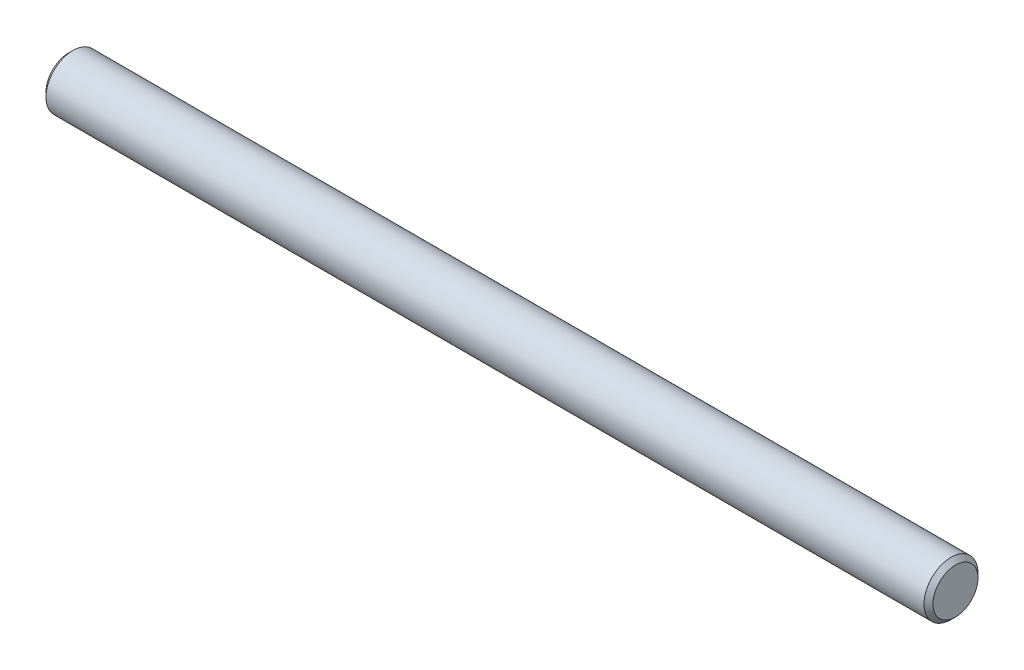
ISO-10303-21;
HEADER;
FILE_DESCRIPTION(('STEP AP214'),'2;1');
FILE_NAME('part.step','',(''),(''),'','','');
FILE_SCHEMA(('AUTOMOTIVE_DESIGN { 1 0 10303 214 1 1 1 1 }'));
ENDSEC;
DATA;
#1=APPLICATION_CONTEXT('core data for automotive mechanical design processes');
#2=APPLICATION_PROTOCOL_DEFINITION('international standard','automotive_design',2000,#1);
#3=PRODUCT_CONTEXT('',#1,'mechanical');
#4=PRODUCT('Part','Part','',(#3));
#5=PRODUCT_RELATED_PRODUCT_CATEGORY('part','',(#4));
#6=PRODUCT_DEFINITION_FORMATION('','',#4);
#7=PRODUCT_DEFINITION_CONTEXT('part definition',#1,'design');
#8=PRODUCT_DEFINITION('design','',#6,#7);
#9=PRODUCT_DEFINITION_SHAPE('','',#8);
#10=(LENGTH_UNIT() NAMED_UNIT(*) SI_UNIT(.MILLI.,.METRE.));
#11=(NAMED_UNIT(*) PLANE_ANGLE_UNIT() SI_UNIT($,.RADIAN.));
#12=(NAMED_UNIT(*) SI_UNIT($,.STERADIAN.) SOLID_ANGLE_UNIT());
#13=UNCERTAINTY_MEASURE_WITH_UNIT(LENGTH_MEASURE(1.E-05),#10,'distance_accuracy_value','');
#14=(GEOMETRIC_REPRESENTATION_CONTEXT(3) GLOBAL_UNCERTAINTY_ASSIGNED_CONTEXT((#13)) GLOBAL_UNIT_ASSIGNED_CONTEXT((#10,
#11,#12)) REPRESENTATION_CONTEXT('',''));
#15=CARTESIAN_POINT('',(0.,0.,0.));
#16=DIRECTION('',(0.,0.,1.));
#17=DIRECTION('',(1.,0.,0.));
#18=AXIS2_PLACEMENT_3D('',#15,#16,#17);
#19=CARTESIAN_POINT('',(197.,0.,0.));
#20=DIRECTION('',(-1.,0.,0.));
#21=DIRECTION('',(0.,0.,1.));
#22=AXIS2_PLACEMENT_3D('',#19,#20,#21);
#23=CYLINDRICAL_SURFACE('',#22,6.);
#24=CARTESIAN_POINT('',(196.,0.,0.));
#25=DIRECTION('',(1.,0.,0.));
#26=DIRECTION('',(0.,0.,-1.));
#27=AXIS2_PLACEMENT_3D('',#24,#25,#26);
#28=CIRCLE('',#27,6.);
#29=CARTESIAN_POINT('',(196.,0.,-6.));
#30=VERTEX_POINT('',#29);
#31=EDGE_CURVE('E9178',#30,#30,#28,.F.);
#32=ORIENTED_EDGE('',*,*,#31,.T.);
#33=EDGE_LOOP('',(#32));
#34=FACE_BOUND('',#33,.T.);
#35=CARTESIAN_POINT('',(1.,0.,0.));
#36=DIRECTION('',(1.,0.,0.));
#37=DIRECTION('',(0.,0.,-1.));
#38=AXIS2_PLACEMENT_3D('',#35,#36,#37);
#39=CIRCLE('',#38,6.);
#40=CARTESIAN_POINT('',(1.,0.,-6.));
#41=VERTEX_POINT('',#40);
#42=EDGE_CURVE('E9182',#41,#41,#39,.T.);
#43=ORIENTED_EDGE('',*,*,#42,.T.);
#44=EDGE_LOOP('',(#43));
#45=FACE_BOUND('',#44,.T.);
#46=ADVANCED_FACE('F9172',(#34,#45),#23,.T.);
#47=CARTESIAN_POINT('',(197.,0.,0.));
#48=DIRECTION('',(1.,0.,0.));
#49=DIRECTION('',(0.,0.,-1.));
#50=AXIS2_PLACEMENT_3D('',#47,#48,#49);
#51=PLANE('',#50);
#52=CARTESIAN_POINT('',(197.,0.,0.));
#53=DIRECTION('',(1.,0.,0.));
#54=DIRECTION('',(0.,0.,-1.));
#55=AXIS2_PLACEMENT_3D('',#52,#53,#54);
#56=CIRCLE('',#55,5.);
#57=CARTESIAN_POINT('',(197.,0.,-5.));
#58=VERTEX_POINT('',#57);
#59=EDGE_CURVE('E9186',#58,#58,#56,.T.);
#60=ORIENTED_EDGE('',*,*,#59,.T.);
#61=EDGE_LOOP('',(#60));
#62=FACE_BOUND('',#61,.T.);
#63=ADVANCED_FACE('F9192',(#62),#51,.T.);
#64=CARTESIAN_POINT('',(0.,0.,0.));
#65=DIRECTION('',(1.,0.,0.));
#66=DIRECTION('',(0.,0.,-1.));
#67=AXIS2_PLACEMENT_3D('',#64,#65,#66);
#68=PLANE('',#67);
#69=CARTESIAN_POINT('',(0.,0.,0.));
#70=DIRECTION('',(1.,0.,0.));
#71=DIRECTION('',(0.,0.,-1.));
#72=AXIS2_PLACEMENT_3D('',#69,#70,#71);
#73=CIRCLE('',#72,5.00000000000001);
#74=CARTESIAN_POINT('',(0.,0.,-5.00000000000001));
#75=VERTEX_POINT('',#74);
#76=EDGE_CURVE('E10',#75,#75,#73,.F.);
#77=ORIENTED_EDGE('',*,*,#76,.T.);
#78=EDGE_LOOP('',(#77));
#79=FACE_BOUND('',#78,.T.);
#80=ADVANCED_FACE('F9197',(#79),#68,.F.);
#81=CARTESIAN_POINT('',(197.,0.,0.));
#82=DIRECTION('',(-1.,0.,0.));
#83=DIRECTION('',(0.,0.,1.));
#84=AXIS2_PLACEMENT_3D('',#81,#82,#83);
#85=CONICAL_SURFACE('',#84,5.,0.785398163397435);
#86=ORIENTED_EDGE('',*,*,#31,.F.);
#87=EDGE_LOOP('',(#86));
#88=FACE_BOUND('',#87,.T.);
#89=ORIENTED_EDGE('',*,*,#59,.F.);
#90=EDGE_LOOP('',(#89));
#91=FACE_BOUND('',#90,.T.);
#92=ADVANCED_FACE('F9194',(#88,#91),#85,.T.);
#93=CARTESIAN_POINT('',(1.,0.,0.));
#94=DIRECTION('',(1.,0.,0.));
#95=DIRECTION('',(0.,0.,-1.));
#96=AXIS2_PLACEMENT_3D('',#93,#94,#95);
#97=CONICAL_SURFACE('',#96,6.,0.785398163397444);
#98=ORIENTED_EDGE('',*,*,#76,.F.);
#99=EDGE_LOOP('',(#98));
#100=FACE_BOUND('',#99,.T.);
#101=ORIENTED_EDGE('',*,*,#42,.F.);
#102=EDGE_LOOP('',(#101));
#103=FACE_BOUND('',#102,.T.);
#104=ADVANCED_FACE('F9196',(#100,#103),#97,.T.);
#105=CLOSED_SHELL('',(#46,#63,#80,#92,#104));
#106=MANIFOLD_SOLID_BREP('B2',#105);
#107=ADVANCED_BREP_SHAPE_REPRESENTATION('',(#18,#106),#14);
#108=SHAPE_DEFINITION_REPRESENTATION(#9,#107);
ENDSEC;
END-ISO-10303-21;
